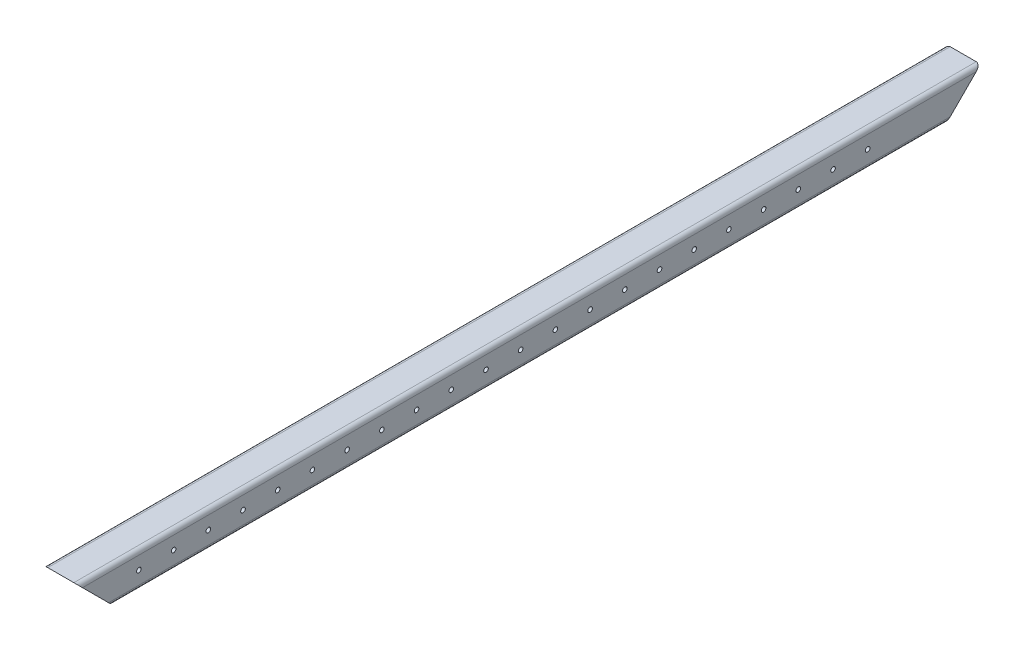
from build123d import *

# Parameters (mm, degrees)
SKETCH1_W               = 38.1
SKETCH1_H               = 38.1
BOSS_EXTRUDE1_DEPTH     = 1320.8
CUT_EXTRUDE1_DEPTH      = 1323.020589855
CUT_EXTRUDE1_DEPTH_BACK = 1323.020589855
CUT_EXTRUDE2_DEPTH      = 1323.020589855
CUT_EXTRUDE2_DEPTH_BACK = 1323.020589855
SKETCH4_R               = 3.3655
CUT_EXTRUDE3_DEPTH      = 660.4


with BuildPart() as part:
    # Sketch1 → Boss-Extrude1 (new body)
    with BuildSketch(Plane.XY):
        with BuildLine():
            Line((-19.05, -25.4), (19.05, -25.4))
            ThreePointArc((19.05, -25.4), (23.540128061, -23.540128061), (25.4, -19.05))
            Line((25.4, -19.05), (25.4, 19.05))
            ThreePointArc((25.4, 19.05), (23.540128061, 23.540128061), (19.05, 25.4))
            Line((19.05, 25.4), (-19.05, 25.4))
            ThreePointArc((-19.05, 25.4), (-23.540128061, 23.540128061), (-25.4, 19.05))
            Line((-25.4, 19.05), (-25.4, -19.05))
            ThreePointArc((-25.4, -19.05), (-23.540128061, -23.540128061), (-19.05, -25.4))
        make_face()
        Rectangle(SKETCH1_W, SKETCH1_H, mode=Mode.SUBTRACT)
    extrude(amount=-BOSS_EXTRUDE1_DEPTH)

    # Sketch2 → Cut-Extrude1 (cut, two sides: drawn at the far end of the back side and taken through both)
    with BuildSketch(Plane(origin=(25.4, 0, 0), x_dir=(0, 0, -1), z_dir=(1, 0, 0)).offset(-CUT_EXTRUDE1_DEPTH_BACK)):
        Polygon((-1876.345408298, 1901.745408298), (0, 25.4), (50.8, -25.4), (1927.145408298, -1901.745408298), (-1825.545408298, -5654.436224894), (-5629.036224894, -1850.945408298), align=None)
    extrude(amount=CUT_EXTRUDE1_DEPTH + CUT_EXTRUDE1_DEPTH_BACK, mode=Mode.SUBTRACT)

    # Sketch3 → Cut-Extrude2 (cut, two sides: drawn at the far end of the back side and taken through both)
    with BuildSketch(Plane(origin=(25.4, 0, 0), x_dir=(0, 0, -1), z_dir=(1, 0, 0)).offset(-CUT_EXTRUDE2_DEPTH_BACK)):
        Polygon((3197.145408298, 1901.745408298), (1320.8, 25.4), (1270, -25.4), (-606.345408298, -1901.745408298), (3146.345408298, -5654.436224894), (6949.836224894, -1850.945408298), align=None)
    extrude(amount=CUT_EXTRUDE2_DEPTH + CUT_EXTRUDE2_DEPTH_BACK, mode=Mode.SUBTRACT)

    # Sketch4 → Cut-Extrude3 (cut)
    with BuildSketch(Plane(origin=(25.4, 0, 0), x_dir=(0, 0, -1), z_dir=(1, 0, 0))):
        with Locations((88.9, 0)):
            Circle(SKETCH4_R)
        with Locations((139.7, 0)):
            Circle(SKETCH4_R)
        with Locations((190.5, 0)):
            Circle(SKETCH4_R)
        with Locations((241.3, 0)):
            Circle(SKETCH4_R)
        with Locations((292.1, 0)):
            Circle(SKETCH4_R)
        with Locations((342.9, 0)):
            Circle(SKETCH4_R)
        with Locations((393.7, 0)):
            Circle(SKETCH4_R)
        with Locations((444.5, 0)):
            Circle(SKETCH4_R)
        with Locations((495.3, 0)):
            Circle(SKETCH4_R)
        with Locations((546.1, 0)):
            Circle(SKETCH4_R)
        with Locations((596.9, 0)):
            Circle(SKETCH4_R)
        with Locations((647.7, 0)):
            Circle(SKETCH4_R)
        with Locations((698.5, 0)):
            Circle(SKETCH4_R)
        with Locations((749.3, 0)):
            Circle(SKETCH4_R)
        with Locations((800.1, 0)):
            Circle(SKETCH4_R)
        with Locations((850.9, 0)):
            Circle(SKETCH4_R)
        with Locations((901.7, 0)):
            Circle(SKETCH4_R)
        with Locations((952.5, 0)):
            Circle(SKETCH4_R)
        with Locations((1003.3, 0)):
            Circle(SKETCH4_R)
        with Locations((1054.1, 0)):
            Circle(SKETCH4_R)
        with Locations((1104.9, 0)):
            Circle(SKETCH4_R)
        with Locations((1155.7, 0)):
            Circle(SKETCH4_R)
    extrude(amount=-CUT_EXTRUDE3_DEPTH, mode=Mode.SUBTRACT)


solid = part.part
